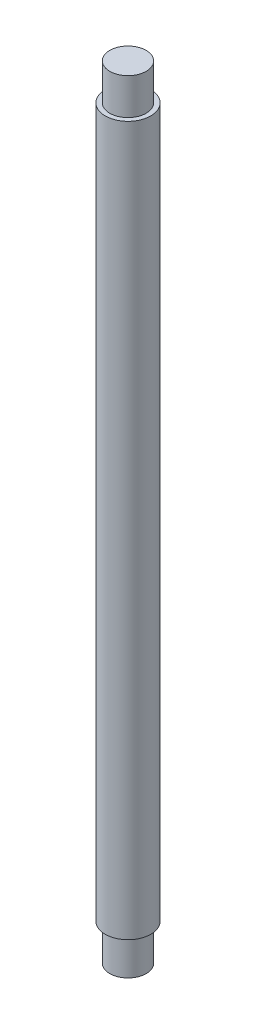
from build123d import *


with BuildPart() as part:
    # Sketch1 → Revolve1 (revolve)
    with BuildSketch(Plane.XY, mode=Mode.PRIVATE) as revolve1_sk:
        Polygon((0, 86), (4, 86), (4, 78), (5, 78), (5, -78), (4, -78), (4, -86), (0, -86), align=None)
    revolve(revolve1_sk.sketch.rotate(Axis((0, 63.397991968, 0), (0, -1, 0)), 90), axis=Axis((0, 63.397991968, 0), (0, -1, 0)))


solid = part.part
